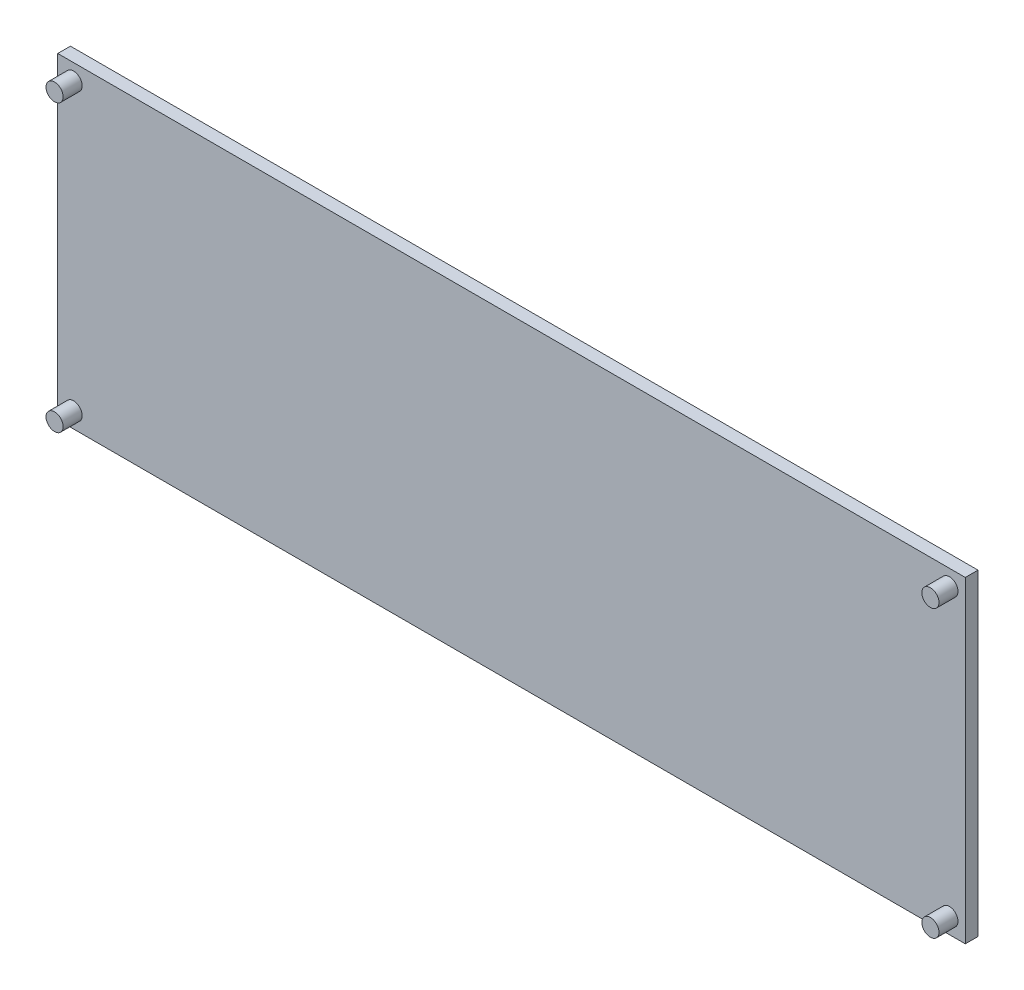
from build123d import *

# Parameters (mm, degrees)
SKETCH1_W           = 143
SKETCH1_H           = 50
SKETCH1_R           = 1.35
BOSS_EXTRUDE1_DEPTH = 2
SKETCH1_2_R         = 1.35
BOSS_EXTRUDE2_DEPTH = 5


with BuildPart() as part:
    # Sketch1 → Boss-Extrude1 (new body)
    with BuildSketch(Plane.XY):
        Rectangle(SKETCH1_W, SKETCH1_H)
        with Locations((-69, 22.5)):
            Circle(SKETCH1_R, mode=Mode.SUBTRACT)
        with Locations(Location((-69, -22.5, 0), (0, 0, 180))):
            Circle(SKETCH1_R, mode=Mode.SUBTRACT)
        with Locations(Location((69, 22.5, 0), (0, 0, 180))):
            Circle(SKETCH1_R, mode=Mode.SUBTRACT)
        with Locations((69, -22.5)):
            Circle(SKETCH1_R, mode=Mode.SUBTRACT)
    extrude(amount=BOSS_EXTRUDE1_DEPTH)

    # Sketch1_2 → Boss-Extrude2 (add)
    with BuildSketch(Plane.XY):
        with Locations(Location((-69, -22.5, 0), (0, 0, 180))):
            Circle(SKETCH1_2_R)
        with Locations((69, -22.5)):
            Circle(SKETCH1_2_R)
        with Locations(Location((69, 22.5, 0), (0, 0, 180))):
            Circle(SKETCH1_2_R)
        with Locations((-69, 22.5)):
            Circle(SKETCH1_2_R)
    extrude(amount=BOSS_EXTRUDE2_DEPTH)


solid = part.part
